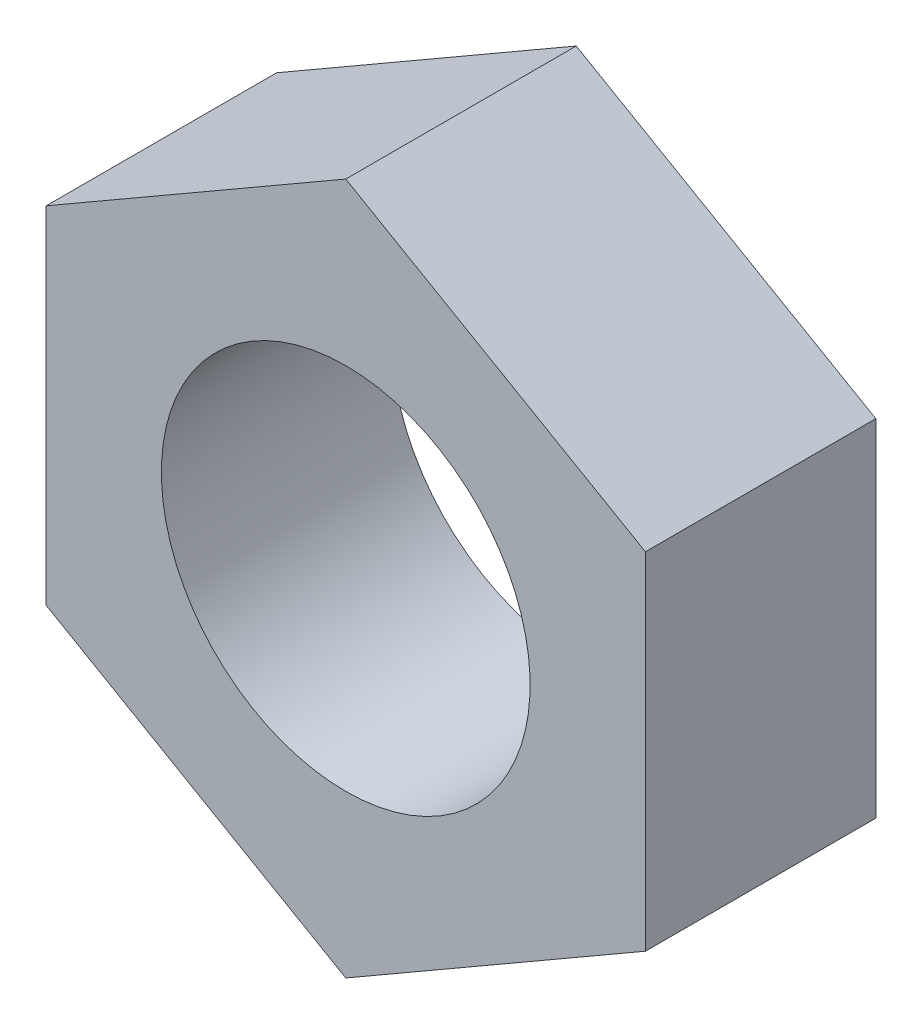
ISO-10303-21;
HEADER;
FILE_DESCRIPTION(('STEP AP214'),'2;1');
FILE_NAME('part.step','',(''),(''),'','','');
FILE_SCHEMA(('AUTOMOTIVE_DESIGN { 1 0 10303 214 1 1 1 1 }'));
ENDSEC;
DATA;
#1=APPLICATION_CONTEXT('core data for automotive mechanical design processes');
#2=APPLICATION_PROTOCOL_DEFINITION('international standard','automotive_design',2000,#1);
#3=PRODUCT_CONTEXT('',#1,'mechanical');
#4=PRODUCT('Part','Part','',(#3));
#5=PRODUCT_RELATED_PRODUCT_CATEGORY('part','',(#4));
#6=PRODUCT_DEFINITION_FORMATION('','',#4);
#7=PRODUCT_DEFINITION_CONTEXT('part definition',#1,'design');
#8=PRODUCT_DEFINITION('design','',#6,#7);
#9=PRODUCT_DEFINITION_SHAPE('','',#8);
#10=(LENGTH_UNIT() NAMED_UNIT(*) SI_UNIT(.MILLI.,.METRE.));
#11=(NAMED_UNIT(*) PLANE_ANGLE_UNIT() SI_UNIT($,.RADIAN.));
#12=(NAMED_UNIT(*) SI_UNIT($,.STERADIAN.) SOLID_ANGLE_UNIT());
#13=UNCERTAINTY_MEASURE_WITH_UNIT(LENGTH_MEASURE(1.E-05),#10,'distance_accuracy_value','');
#14=(GEOMETRIC_REPRESENTATION_CONTEXT(3) GLOBAL_UNCERTAINTY_ASSIGNED_CONTEXT((#13)) GLOBAL_UNIT_ASSIGNED_CONTEXT((#10,
#11,#12)) REPRESENTATION_CONTEXT('',''));
#15=CARTESIAN_POINT('',(0.,0.,0.));
#16=DIRECTION('',(0.,0.,1.));
#17=DIRECTION('',(1.,0.,0.));
#18=AXIS2_PLACEMENT_3D('',#15,#16,#17);
#19=CARTESIAN_POINT('',(0.,-7.50555349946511,5.));
#20=DIRECTION('',(-0.5,-0.86602540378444,0.));
#21=DIRECTION('',(0.86602540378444,-0.5,0.));
#22=AXIS2_PLACEMENT_3D('',#19,#20,#21);
#23=PLANE('',#22);
#24=DIRECTION('',(0.,0.,-1.));
#25=VECTOR('',#24,1.);
#26=CARTESIAN_POINT('',(0.,-7.50555349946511,5.));
#27=LINE('',#26,#25);
#28=CARTESIAN_POINT('',(0.,-7.50555349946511,5.));
#29=VERTEX_POINT('',#28);
#30=CARTESIAN_POINT('',(0.,-7.50555349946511,0.));
#31=VERTEX_POINT('',#30);
#32=EDGE_CURVE('E9',#29,#31,#27,.T.);
#33=ORIENTED_EDGE('',*,*,#32,.F.);
#34=DIRECTION('',(-0.86602540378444,0.5,0.));
#35=VECTOR('',#34,1.);
#36=CARTESIAN_POINT('',(0.,-7.50555349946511,5.));
#37=LINE('',#36,#35);
#38=CARTESIAN_POINT('',(-6.5,-3.75277674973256,5.));
#39=VERTEX_POINT('',#38);
#40=EDGE_CURVE('E69',#29,#39,#37,.T.);
#41=ORIENTED_EDGE('',*,*,#40,.T.);
#42=DIRECTION('',(0.,0.,-1.));
#43=VECTOR('',#42,1.);
#44=CARTESIAN_POINT('',(-6.5,-3.75277674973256,5.));
#45=LINE('',#44,#43);
#46=CARTESIAN_POINT('',(-6.5,-3.75277674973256,0.));
#47=VERTEX_POINT('',#46);
#48=EDGE_CURVE('E65',#39,#47,#45,.T.);
#49=ORIENTED_EDGE('',*,*,#48,.T.);
#50=DIRECTION('',(-0.86602540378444,0.5,0.));
#51=VECTOR('',#50,1.);
#52=CARTESIAN_POINT('',(0.,-7.50555349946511,0.));
#53=LINE('',#52,#51);
#54=EDGE_CURVE('E67',#31,#47,#53,.T.);
#55=ORIENTED_EDGE('',*,*,#54,.F.);
#56=EDGE_LOOP('',(#33,#41,#49,#55));
#57=FACE_BOUND('',#56,.T.);
#58=ADVANCED_FACE('F15',(#57),#23,.T.);
#59=CARTESIAN_POINT('',(0.,-7.50555349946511,5.));
#60=DIRECTION('',(-0.5,0.86602540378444,0.));
#61=DIRECTION('',(-0.86602540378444,-0.5,0.));
#62=AXIS2_PLACEMENT_3D('',#59,#60,#61);
#63=PLANE('',#62);
#64=DIRECTION('',(0.,0.,-1.));
#65=VECTOR('',#64,1.);
#66=CARTESIAN_POINT('',(6.5,-3.75277674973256,5.));
#67=LINE('',#66,#65);
#68=CARTESIAN_POINT('',(6.5,-3.75277674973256,5.));
#69=VERTEX_POINT('',#68);
#70=CARTESIAN_POINT('',(6.5,-3.75277674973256,0.));
#71=VERTEX_POINT('',#70);
#72=EDGE_CURVE('E24',#69,#71,#67,.T.);
#73=ORIENTED_EDGE('',*,*,#72,.F.);
#74=DIRECTION('',(0.86602540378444,0.5,0.));
#75=VECTOR('',#74,1.);
#76=CARTESIAN_POINT('',(0.,-7.50555349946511,5.));
#77=LINE('',#76,#75);
#78=EDGE_CURVE('E76',#29,#69,#77,.T.);
#79=ORIENTED_EDGE('',*,*,#78,.F.);
#80=ORIENTED_EDGE('',*,*,#32,.T.);
#81=DIRECTION('',(0.86602540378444,0.5,0.));
#82=VECTOR('',#81,1.);
#83=CARTESIAN_POINT('',(0.,-7.50555349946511,0.));
#84=LINE('',#83,#82);
#85=EDGE_CURVE('E85',#31,#71,#84,.T.);
#86=ORIENTED_EDGE('',*,*,#85,.T.);
#87=EDGE_LOOP('',(#73,#79,#80,#86));
#88=FACE_BOUND('',#87,.T.);
#89=ADVANCED_FACE('F17',(#88),#63,.F.);
#90=CARTESIAN_POINT('',(6.5,-3.75277674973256,5.));
#91=DIRECTION('',(-1.,0.,0.));
#92=DIRECTION('',(0.,0.,-1.));
#93=AXIS2_PLACEMENT_3D('',#90,#91,#92);
#94=PLANE('',#93);
#95=DIRECTION('',(0.,0.,-1.));
#96=VECTOR('',#95,1.);
#97=CARTESIAN_POINT('',(6.5,3.75277674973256,5.));
#98=LINE('',#97,#96);
#99=CARTESIAN_POINT('',(6.5,3.75277674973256,5.));
#100=VERTEX_POINT('',#99);
#101=CARTESIAN_POINT('',(6.5,3.75277674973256,0.));
#102=VERTEX_POINT('',#101);
#103=EDGE_CURVE('E133',#100,#102,#98,.T.);
#104=ORIENTED_EDGE('',*,*,#103,.F.);
#105=DIRECTION('',(0.,1.,0.));
#106=VECTOR('',#105,1.);
#107=CARTESIAN_POINT('',(6.5,-3.75277674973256,5.));
#108=LINE('',#107,#106);
#109=EDGE_CURVE('E121',#69,#100,#108,.T.);
#110=ORIENTED_EDGE('',*,*,#109,.F.);
#111=ORIENTED_EDGE('',*,*,#72,.T.);
#112=DIRECTION('',(0.,1.,0.));
#113=VECTOR('',#112,1.);
#114=CARTESIAN_POINT('',(6.5,-3.75277674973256,0.));
#115=LINE('',#114,#113);
#116=EDGE_CURVE('E102',#71,#102,#115,.T.);
#117=ORIENTED_EDGE('',*,*,#116,.T.);
#118=EDGE_LOOP('',(#104,#110,#111,#117));
#119=FACE_BOUND('',#118,.T.);
#120=ADVANCED_FACE('F137',(#119),#94,.F.);
#121=CARTESIAN_POINT('',(0.,7.50555349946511,5.));
#122=DIRECTION('',(0.5,0.86602540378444,0.));
#123=DIRECTION('',(-0.86602540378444,0.5,0.));
#124=AXIS2_PLACEMENT_3D('',#121,#122,#123);
#125=PLANE('',#124);
#126=DIRECTION('',(0.,0.,-1.));
#127=VECTOR('',#126,1.);
#128=CARTESIAN_POINT('',(0.,7.50555349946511,5.));
#129=LINE('',#128,#127);
#130=CARTESIAN_POINT('',(0.,7.50555349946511,5.));
#131=VERTEX_POINT('',#130);
#132=CARTESIAN_POINT('',(0.,7.50555349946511,0.));
#133=VERTEX_POINT('',#132);
#134=EDGE_CURVE('E130',#131,#133,#129,.T.);
#135=ORIENTED_EDGE('',*,*,#134,.F.);
#136=DIRECTION('',(0.86602540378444,-0.5,0.));
#137=VECTOR('',#136,1.);
#138=CARTESIAN_POINT('',(0.,7.50555349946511,5.));
#139=LINE('',#138,#137);
#140=EDGE_CURVE('E117',#131,#100,#139,.T.);
#141=ORIENTED_EDGE('',*,*,#140,.T.);
#142=ORIENTED_EDGE('',*,*,#103,.T.);
#143=DIRECTION('',(0.86602540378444,-0.5,0.));
#144=VECTOR('',#143,1.);
#145=CARTESIAN_POINT('',(0.,7.50555349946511,0.));
#146=LINE('',#145,#144);
#147=EDGE_CURVE('E95',#133,#102,#146,.T.);
#148=ORIENTED_EDGE('',*,*,#147,.F.);
#149=EDGE_LOOP('',(#135,#141,#142,#148));
#150=FACE_BOUND('',#149,.T.);
#151=ADVANCED_FACE('F146',(#150),#125,.T.);
#152=CARTESIAN_POINT('',(0.,7.50555349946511,5.));
#153=DIRECTION('',(0.5,-0.86602540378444,0.));
#154=DIRECTION('',(0.86602540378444,0.5,0.));
#155=AXIS2_PLACEMENT_3D('',#152,#153,#154);
#156=PLANE('',#155);
#157=DIRECTION('',(0.,0.,-1.));
#158=VECTOR('',#157,1.);
#159=CARTESIAN_POINT('',(-6.5,3.75277674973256,5.));
#160=LINE('',#159,#158);
#161=CARTESIAN_POINT('',(-6.5,3.75277674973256,5.));
#162=VERTEX_POINT('',#161);
#163=CARTESIAN_POINT('',(-6.5,3.75277674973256,0.));
#164=VERTEX_POINT('',#163);
#165=EDGE_CURVE('E75',#162,#164,#160,.T.);
#166=ORIENTED_EDGE('',*,*,#165,.F.);
#167=DIRECTION('',(-0.86602540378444,-0.5,0.));
#168=VECTOR('',#167,1.);
#169=CARTESIAN_POINT('',(0.,7.50555349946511,5.));
#170=LINE('',#169,#168);
#171=EDGE_CURVE('E113',#131,#162,#170,.T.);
#172=ORIENTED_EDGE('',*,*,#171,.F.);
#173=ORIENTED_EDGE('',*,*,#134,.T.);
#174=DIRECTION('',(-0.86602540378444,-0.5,0.));
#175=VECTOR('',#174,1.);
#176=CARTESIAN_POINT('',(0.,7.50555349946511,0.));
#177=LINE('',#176,#175);
#178=EDGE_CURVE('E91',#133,#164,#177,.T.);
#179=ORIENTED_EDGE('',*,*,#178,.T.);
#180=EDGE_LOOP('',(#166,#172,#173,#179));
#181=FACE_BOUND('',#180,.T.);
#182=ADVANCED_FACE('F144',(#181),#156,.F.);
#183=CARTESIAN_POINT('',(-6.5,-3.75277674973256,5.));
#184=DIRECTION('',(-1.,0.,0.));
#185=DIRECTION('',(0.,0.,-1.));
#186=AXIS2_PLACEMENT_3D('',#183,#184,#185);
#187=PLANE('',#186);
#188=DIRECTION('',(0.,1.,0.));
#189=VECTOR('',#188,1.);
#190=CARTESIAN_POINT('',(-6.5,-3.75277674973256,5.));
#191=LINE('',#190,#189);
#192=EDGE_CURVE('E110',#39,#162,#191,.T.);
#193=ORIENTED_EDGE('',*,*,#192,.T.);
#194=ORIENTED_EDGE('',*,*,#165,.T.);
#195=DIRECTION('',(0.,1.,0.));
#196=VECTOR('',#195,1.);
#197=CARTESIAN_POINT('',(-6.5,-3.75277674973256,0.));
#198=LINE('',#197,#196);
#199=EDGE_CURVE('E82',#47,#164,#198,.T.);
#200=ORIENTED_EDGE('',*,*,#199,.F.);
#201=ORIENTED_EDGE('',*,*,#48,.F.);
#202=EDGE_LOOP('',(#193,#194,#200,#201));
#203=FACE_BOUND('',#202,.T.);
#204=ADVANCED_FACE('F89',(#203),#187,.T.);
#205=CARTESIAN_POINT('',(-6.5,-3.75277674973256,5.));
#206=DIRECTION('',(0.,0.,-1.));
#207=DIRECTION('',(0.,1.,0.));
#208=AXIS2_PLACEMENT_3D('',#205,#206,#207);
#209=PLANE('',#208);
#210=CARTESIAN_POINT('',(0.,0.,5.));
#211=DIRECTION('',(0.,0.,-1.));
#212=DIRECTION('',(0.,1.,0.));
#213=AXIS2_PLACEMENT_3D('',#210,#211,#212);
#214=CIRCLE('',#213,4.);
#215=CARTESIAN_POINT('',(0.,4.,5.));
#216=VERTEX_POINT('',#215);
#217=EDGE_CURVE('E87',#216,#216,#214,.T.);
#218=ORIENTED_EDGE('',*,*,#217,.T.);
#219=EDGE_LOOP('',(#218));
#220=FACE_BOUND('',#219,.T.);
#221=ORIENTED_EDGE('',*,*,#40,.F.);
#222=ORIENTED_EDGE('',*,*,#78,.T.);
#223=ORIENTED_EDGE('',*,*,#109,.T.);
#224=ORIENTED_EDGE('',*,*,#140,.F.);
#225=ORIENTED_EDGE('',*,*,#171,.T.);
#226=ORIENTED_EDGE('',*,*,#192,.F.);
#227=EDGE_LOOP('',(#221,#222,#223,#224,#225,#226));
#228=FACE_BOUND('',#227,.T.);
#229=ADVANCED_FACE('F140',(#220,#228),#209,.F.);
#230=CARTESIAN_POINT('',(-6.5,-3.75277674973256,0.));
#231=DIRECTION('',(0.,0.,-1.));
#232=DIRECTION('',(0.,1.,0.));
#233=AXIS2_PLACEMENT_3D('',#230,#231,#232);
#234=PLANE('',#233);
#235=CARTESIAN_POINT('',(0.,0.,0.));
#236=DIRECTION('',(0.,0.,-1.));
#237=DIRECTION('',(0.,1.,0.));
#238=AXIS2_PLACEMENT_3D('',#235,#236,#237);
#239=CIRCLE('',#238,4.);
#240=CARTESIAN_POINT('',(0.,4.,0.));
#241=VERTEX_POINT('',#240);
#242=EDGE_CURVE('E182',#241,#241,#239,.T.);
#243=ORIENTED_EDGE('',*,*,#242,.F.);
#244=EDGE_LOOP('',(#243));
#245=FACE_BOUND('',#244,.T.);
#246=ORIENTED_EDGE('',*,*,#54,.T.);
#247=ORIENTED_EDGE('',*,*,#199,.T.);
#248=ORIENTED_EDGE('',*,*,#178,.F.);
#249=ORIENTED_EDGE('',*,*,#147,.T.);
#250=ORIENTED_EDGE('',*,*,#116,.F.);
#251=ORIENTED_EDGE('',*,*,#85,.F.);
#252=EDGE_LOOP('',(#246,#247,#248,#249,#250,#251));
#253=FACE_BOUND('',#252,.T.);
#254=ADVANCED_FACE('F80',(#245,#253),#234,.T.);
#255=CARTESIAN_POINT('',(0.,0.,5.));
#256=DIRECTION('',(0.,0.,-1.));
#257=DIRECTION('',(0.,1.,0.));
#258=AXIS2_PLACEMENT_3D('',#255,#256,#257);
#259=CYLINDRICAL_SURFACE('',#258,4.);
#260=ORIENTED_EDGE('',*,*,#217,.F.);
#261=EDGE_LOOP('',(#260));
#262=FACE_BOUND('',#261,.T.);
#263=ORIENTED_EDGE('',*,*,#242,.T.);
#264=EDGE_LOOP('',(#263));
#265=FACE_BOUND('',#264,.T.);
#266=ADVANCED_FACE('F172',(#262,#265),#259,.F.);
#267=CLOSED_SHELL('',(#58,#89,#120,#151,#182,#204,#229,#254,#266));
#268=MANIFOLD_SOLID_BREP('B1',#267);
#269=ADVANCED_BREP_SHAPE_REPRESENTATION('',(#18,#268),#14);
#270=SHAPE_DEFINITION_REPRESENTATION(#9,#269);
ENDSEC;
END-ISO-10303-21;
